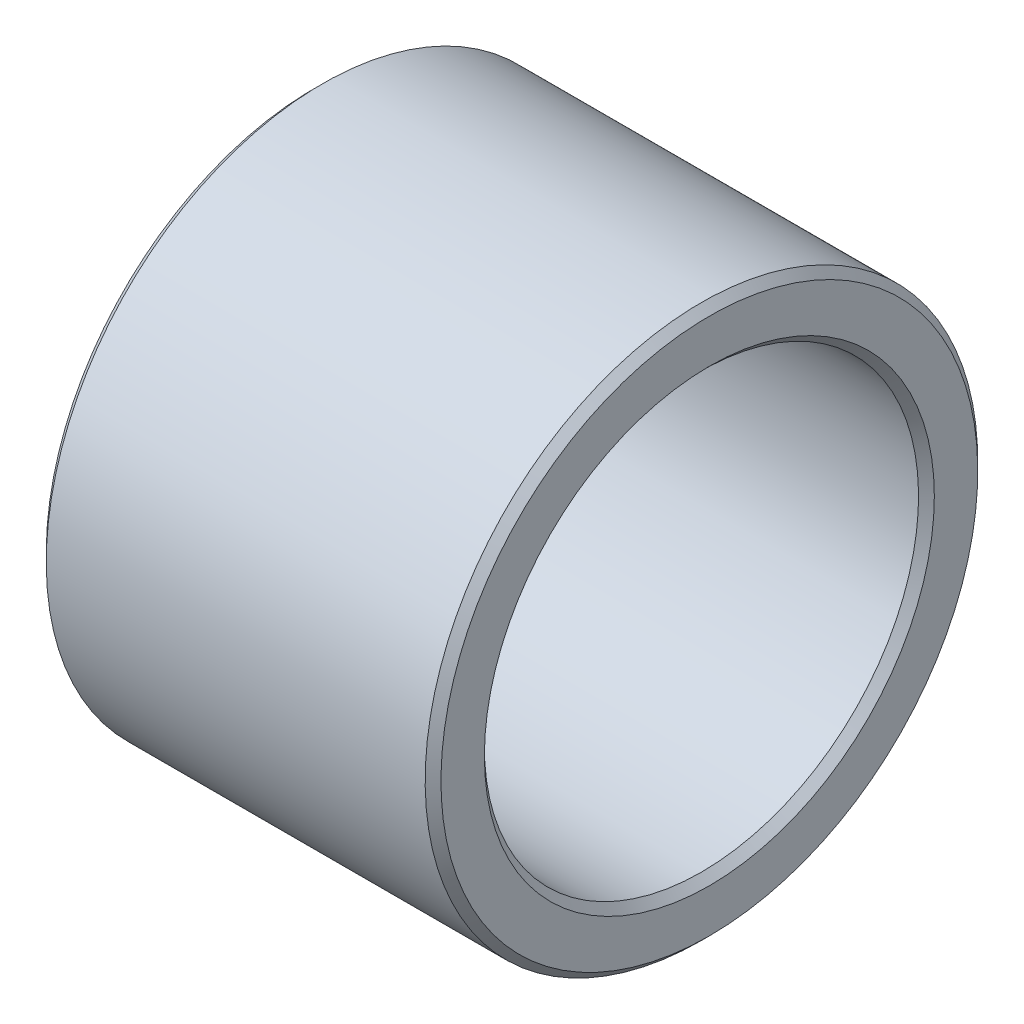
ISO-10303-21;
HEADER;
FILE_DESCRIPTION(('STEP AP214'),'2;1');
FILE_NAME('part.step','',(''),(''),'','','');
FILE_SCHEMA(('AUTOMOTIVE_DESIGN { 1 0 10303 214 1 1 1 1 }'));
ENDSEC;
DATA;
#1=APPLICATION_CONTEXT('core data for automotive mechanical design processes');
#2=APPLICATION_PROTOCOL_DEFINITION('international standard','automotive_design',2000,#1);
#3=PRODUCT_CONTEXT('',#1,'mechanical');
#4=PRODUCT('Part','Part','',(#3));
#5=PRODUCT_RELATED_PRODUCT_CATEGORY('part','',(#4));
#6=PRODUCT_DEFINITION_FORMATION('','',#4);
#7=PRODUCT_DEFINITION_CONTEXT('part definition',#1,'design');
#8=PRODUCT_DEFINITION('design','',#6,#7);
#9=PRODUCT_DEFINITION_SHAPE('','',#8);
#10=(LENGTH_UNIT() NAMED_UNIT(*) SI_UNIT(.MILLI.,.METRE.));
#11=(NAMED_UNIT(*) PLANE_ANGLE_UNIT() SI_UNIT($,.RADIAN.));
#12=(NAMED_UNIT(*) SI_UNIT($,.STERADIAN.) SOLID_ANGLE_UNIT());
#13=UNCERTAINTY_MEASURE_WITH_UNIT(LENGTH_MEASURE(1.E-05),#10,'distance_accuracy_value','');
#14=(GEOMETRIC_REPRESENTATION_CONTEXT(3) GLOBAL_UNCERTAINTY_ASSIGNED_CONTEXT((#13)) GLOBAL_UNIT_ASSIGNED_CONTEXT((#10,
#11,#12)) REPRESENTATION_CONTEXT('',''));
#15=CARTESIAN_POINT('',(0.,0.,0.));
#16=DIRECTION('',(0.,0.,1.));
#17=DIRECTION('',(1.,0.,0.));
#18=AXIS2_PLACEMENT_3D('',#15,#16,#17);
#19=CARTESIAN_POINT('',(0.,-12.5,0.));
#20=DIRECTION('',(-1.,0.,0.));
#21=DIRECTION('',(0.,1.,0.));
#22=AXIS2_PLACEMENT_3D('',#19,#20,#21);
#23=PLANE('',#22);
#24=CARTESIAN_POINT('',(0.,0.,0.));
#25=DIRECTION('',(1.,0.,0.));
#26=DIRECTION('',(0.,-1.,0.));
#27=AXIS2_PLACEMENT_3D('',#24,#25,#26);
#28=CIRCLE('',#27,11.4);
#29=CARTESIAN_POINT('',(0.,-11.4,0.));
#30=VERTEX_POINT('',#29);
#31=EDGE_CURVE('E9',#30,#30,#28,.T.);
#32=ORIENTED_EDGE('',*,*,#31,.T.);
#33=EDGE_LOOP('',(#32));
#34=FACE_BOUND('',#33,.T.);
#35=CARTESIAN_POINT('',(0.,0.,0.));
#36=DIRECTION('',(1.,0.,0.));
#37=DIRECTION('',(0.,-1.,0.));
#38=AXIS2_PLACEMENT_3D('',#35,#36,#37);
#39=CIRCLE('',#38,13.6);
#40=CARTESIAN_POINT('',(0.,-13.6,0.));
#41=VERTEX_POINT('',#40);
#42=EDGE_CURVE('E53',#41,#41,#39,.T.);
#43=ORIENTED_EDGE('',*,*,#42,.F.);
#44=EDGE_LOOP('',(#43));
#45=FACE_BOUND('',#44,.T.);
#46=ADVANCED_FACE('F15',(#34,#45),#23,.T.);
#47=CARTESIAN_POINT('',(0.2,0.,0.));
#48=DIRECTION('',(-1.,0.,0.));
#49=DIRECTION('',(0.,-1.,0.));
#50=AXIS2_PLACEMENT_3D('',#47,#48,#49);
#51=CONICAL_SURFACE('',#50,11.2,0.785398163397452);
#52=CARTESIAN_POINT('',(0.4,0.,0.));
#53=DIRECTION('',(1.,0.,0.));
#54=DIRECTION('',(0.,-1.,0.));
#55=AXIS2_PLACEMENT_3D('',#52,#53,#54);
#56=CIRCLE('',#55,11.);
#57=CARTESIAN_POINT('',(0.4,-11.,0.));
#58=VERTEX_POINT('',#57);
#59=EDGE_CURVE('E22',#58,#58,#56,.T.);
#60=ORIENTED_EDGE('',*,*,#59,.T.);
#61=EDGE_LOOP('',(#60));
#62=FACE_BOUND('',#61,.T.);
#63=ORIENTED_EDGE('',*,*,#31,.F.);
#64=EDGE_LOOP('',(#63));
#65=FACE_BOUND('',#64,.T.);
#66=ADVANCED_FACE('F82',(#62,#65),#51,.F.);
#67=CARTESIAN_POINT('',(10.,0.,0.));
#68=DIRECTION('',(-1.,0.,0.));
#69=DIRECTION('',(0.,-1.,0.));
#70=AXIS2_PLACEMENT_3D('',#67,#68,#69);
#71=CYLINDRICAL_SURFACE('',#70,11.);
#72=CARTESIAN_POINT('',(19.6,0.,0.));
#73=DIRECTION('',(1.,0.,0.));
#74=DIRECTION('',(0.,-1.,0.));
#75=AXIS2_PLACEMENT_3D('',#72,#73,#74);
#76=CIRCLE('',#75,11.);
#77=CARTESIAN_POINT('',(19.6,-11.,0.));
#78=VERTEX_POINT('',#77);
#79=EDGE_CURVE('E58',#78,#78,#76,.T.);
#80=ORIENTED_EDGE('',*,*,#79,.T.);
#81=EDGE_LOOP('',(#80));
#82=FACE_BOUND('',#81,.T.);
#83=ORIENTED_EDGE('',*,*,#59,.F.);
#84=EDGE_LOOP('',(#83));
#85=FACE_BOUND('',#84,.T.);
#86=ADVANCED_FACE('F66',(#82,#85),#71,.F.);
#87=CARTESIAN_POINT('',(19.8,0.,0.));
#88=DIRECTION('',(1.,0.,0.));
#89=DIRECTION('',(0.,-1.,0.));
#90=AXIS2_PLACEMENT_3D('',#87,#88,#89);
#91=CONICAL_SURFACE('',#90,11.2,0.785398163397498);
#92=CARTESIAN_POINT('',(20.,0.,0.));
#93=DIRECTION('',(1.,0.,0.));
#94=DIRECTION('',(0.,-1.,0.));
#95=AXIS2_PLACEMENT_3D('',#92,#93,#94);
#96=CIRCLE('',#95,11.4);
#97=CARTESIAN_POINT('',(20.,-11.4,0.));
#98=VERTEX_POINT('',#97);
#99=EDGE_CURVE('E63',#98,#98,#96,.T.);
#100=ORIENTED_EDGE('',*,*,#99,.T.);
#101=EDGE_LOOP('',(#100));
#102=FACE_BOUND('',#101,.T.);
#103=ORIENTED_EDGE('',*,*,#79,.F.);
#104=EDGE_LOOP('',(#103));
#105=FACE_BOUND('',#104,.T.);
#106=ADVANCED_FACE('F69',(#102,#105),#91,.F.);
#107=CARTESIAN_POINT('',(20.,-12.5,0.));
#108=DIRECTION('',(1.,0.,0.));
#109=DIRECTION('',(0.,-1.,0.));
#110=AXIS2_PLACEMENT_3D('',#107,#108,#109);
#111=PLANE('',#110);
#112=CARTESIAN_POINT('',(20.,0.,0.));
#113=DIRECTION('',(1.,0.,0.));
#114=DIRECTION('',(0.,-1.,0.));
#115=AXIS2_PLACEMENT_3D('',#112,#113,#114);
#116=CIRCLE('',#115,13.6);
#117=CARTESIAN_POINT('',(20.,-13.6,0.));
#118=VERTEX_POINT('',#117);
#119=EDGE_CURVE('E61',#118,#118,#116,.T.);
#120=ORIENTED_EDGE('',*,*,#119,.T.);
#121=EDGE_LOOP('',(#120));
#122=FACE_BOUND('',#121,.T.);
#123=ORIENTED_EDGE('',*,*,#99,.F.);
#124=EDGE_LOOP('',(#123));
#125=FACE_BOUND('',#124,.T.);
#126=ADVANCED_FACE('F71',(#122,#125),#111,.T.);
#127=CARTESIAN_POINT('',(19.8,0.,0.));
#128=DIRECTION('',(-1.,0.,0.));
#129=DIRECTION('',(0.,-1.,0.));
#130=AXIS2_PLACEMENT_3D('',#127,#128,#129);
#131=CONICAL_SURFACE('',#130,13.8,0.785398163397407);
#132=CARTESIAN_POINT('',(19.6,0.,0.));
#133=DIRECTION('',(1.,0.,0.));
#134=DIRECTION('',(0.,-1.,0.));
#135=AXIS2_PLACEMENT_3D('',#132,#133,#134);
#136=CIRCLE('',#135,14.);
#137=CARTESIAN_POINT('',(19.6,-14.,0.));
#138=VERTEX_POINT('',#137);
#139=EDGE_CURVE('E55',#138,#138,#136,.T.);
#140=ORIENTED_EDGE('',*,*,#139,.T.);
#141=EDGE_LOOP('',(#140));
#142=FACE_BOUND('',#141,.T.);
#143=ORIENTED_EDGE('',*,*,#119,.F.);
#144=EDGE_LOOP('',(#143));
#145=FACE_BOUND('',#144,.T.);
#146=ADVANCED_FACE('F79',(#142,#145),#131,.T.);
#147=CARTESIAN_POINT('',(10.,0.,0.));
#148=DIRECTION('',(-1.,0.,0.));
#149=DIRECTION('',(0.,-1.,0.));
#150=AXIS2_PLACEMENT_3D('',#147,#148,#149);
#151=CYLINDRICAL_SURFACE('',#150,14.);
#152=CARTESIAN_POINT('',(0.4,0.,0.));
#153=DIRECTION('',(1.,0.,0.));
#154=DIRECTION('',(0.,-1.,0.));
#155=AXIS2_PLACEMENT_3D('',#152,#153,#154);
#156=CIRCLE('',#155,14.);
#157=CARTESIAN_POINT('',(0.4,-14.,0.));
#158=VERTEX_POINT('',#157);
#159=EDGE_CURVE('E49',#158,#158,#156,.T.);
#160=ORIENTED_EDGE('',*,*,#159,.T.);
#161=EDGE_LOOP('',(#160));
#162=FACE_BOUND('',#161,.T.);
#163=ORIENTED_EDGE('',*,*,#139,.F.);
#164=EDGE_LOOP('',(#163));
#165=FACE_BOUND('',#164,.T.);
#166=ADVANCED_FACE('F50',(#162,#165),#151,.T.);
#167=CARTESIAN_POINT('',(0.2,0.,0.));
#168=DIRECTION('',(1.,0.,0.));
#169=DIRECTION('',(0.,-1.,0.));
#170=AXIS2_PLACEMENT_3D('',#167,#168,#169);
#171=CONICAL_SURFACE('',#170,13.8,0.785398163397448);
#172=ORIENTED_EDGE('',*,*,#42,.T.);
#173=EDGE_LOOP('',(#172));
#174=FACE_BOUND('',#173,.T.);
#175=ORIENTED_EDGE('',*,*,#159,.F.);
#176=EDGE_LOOP('',(#175));
#177=FACE_BOUND('',#176,.T.);
#178=ADVANCED_FACE('F92',(#174,#177),#171,.T.);
#179=CLOSED_SHELL('',(#46,#66,#86,#106,#126,#146,#166,#178));
#180=MANIFOLD_SOLID_BREP('B1',#179);
#181=ADVANCED_BREP_SHAPE_REPRESENTATION('',(#18,#180),#14);
#182=SHAPE_DEFINITION_REPRESENTATION(#9,#181);
ENDSEC;
END-ISO-10303-21;
